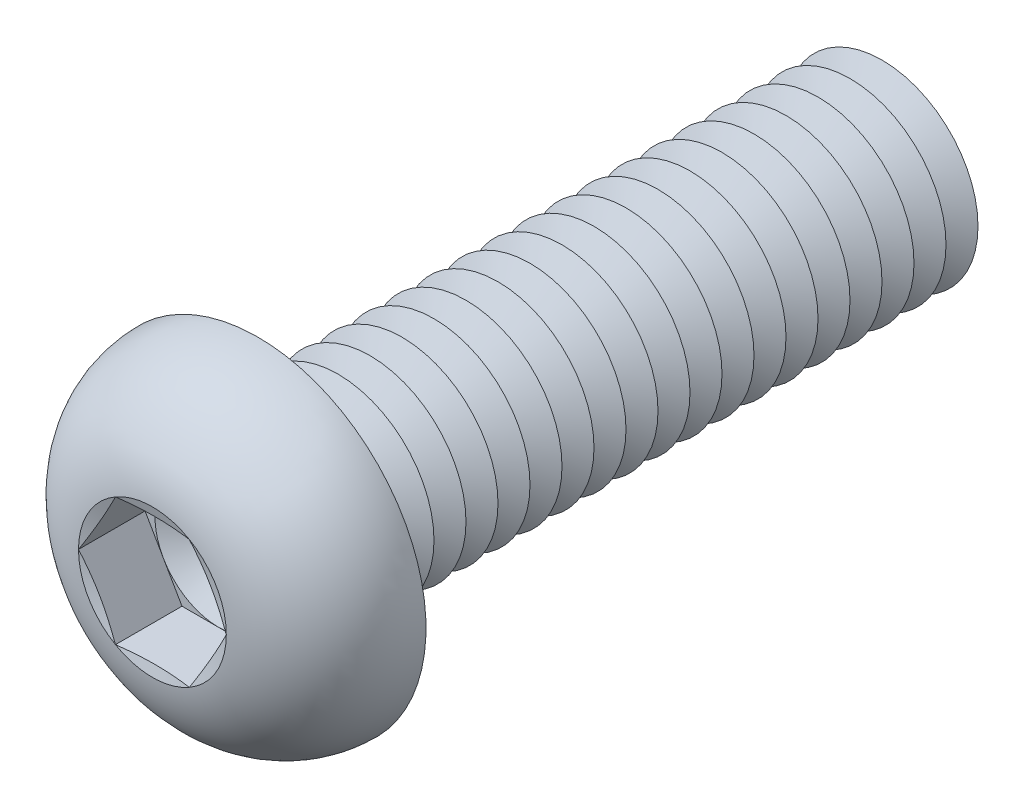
ISO-10303-21;
HEADER;
FILE_DESCRIPTION(('STEP AP214'),'2;1');
FILE_NAME('part.step','',(''),(''),'','','');
FILE_SCHEMA(('AUTOMOTIVE_DESIGN { 1 0 10303 214 1 1 1 1 }'));
ENDSEC;
DATA;
#1=APPLICATION_CONTEXT('core data for automotive mechanical design processes');
#2=APPLICATION_PROTOCOL_DEFINITION('international standard','automotive_design',2000,#1);
#3=PRODUCT_CONTEXT('',#1,'mechanical');
#4=PRODUCT('Part','Part','',(#3));
#5=PRODUCT_RELATED_PRODUCT_CATEGORY('part','',(#4));
#6=PRODUCT_DEFINITION_FORMATION('','',#4);
#7=PRODUCT_DEFINITION_CONTEXT('part definition',#1,'design');
#8=PRODUCT_DEFINITION('design','',#6,#7);
#9=PRODUCT_DEFINITION_SHAPE('','',#8);
#10=(LENGTH_UNIT() NAMED_UNIT(*) SI_UNIT(.MILLI.,.METRE.));
#11=(NAMED_UNIT(*) PLANE_ANGLE_UNIT() SI_UNIT($,.RADIAN.));
#12=(NAMED_UNIT(*) SI_UNIT($,.STERADIAN.) SOLID_ANGLE_UNIT());
#13=UNCERTAINTY_MEASURE_WITH_UNIT(LENGTH_MEASURE(1.E-05),#10,'distance_accuracy_value','');
#14=(GEOMETRIC_REPRESENTATION_CONTEXT(3) GLOBAL_UNCERTAINTY_ASSIGNED_CONTEXT((#13)) GLOBAL_UNIT_ASSIGNED_CONTEXT((#10,
#11,#12)) REPRESENTATION_CONTEXT('',''));
#15=CARTESIAN_POINT('',(0.,0.,0.));
#16=DIRECTION('',(0.,0.,1.));
#17=DIRECTION('',(1.,0.,0.));
#18=AXIS2_PLACEMENT_3D('',#15,#16,#17);
#19=CARTESIAN_POINT('',(0.,0.,1.22));
#20=DIRECTION('',(0.,0.,1.));
#21=DIRECTION('',(1.,0.,0.));
#22=AXIS2_PLACEMENT_3D('',#19,#20,#21);
#23=PLANE('',#22);
#24=CARTESIAN_POINT('',(0.,0.,1.22));
#25=DIRECTION('',(0.,0.,1.));
#26=DIRECTION('',(1.,0.,0.));
#27=AXIS2_PLACEMENT_3D('',#24,#25,#26);
#28=CIRCLE('',#27,1.99999906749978);
#29=CARTESIAN_POINT('',(1.73205,0.999999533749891,1.22));
#30=VERTEX_POINT('',#29);
#31=CARTESIAN_POINT('',(0.,1.99999906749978,1.22));
#32=VERTEX_POINT('',#31);
#33=EDGE_CURVE('E118',#30,#32,#28,.T.);
#34=ORIENTED_EDGE('',*,*,#33,.F.);
#35=DIRECTION('',(-0.5,0.866025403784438,0.));
#36=VECTOR('',#35,1.);
#37=CARTESIAN_POINT('',(2.3094,0.,1.22));
#38=LINE('',#37,#36);
#39=CARTESIAN_POINT('',(1.1547,1.99999906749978,1.22));
#40=VERTEX_POINT('',#39);
#41=EDGE_CURVE('E125',#30,#40,#38,.T.);
#42=ORIENTED_EDGE('',*,*,#41,.T.);
#43=DIRECTION('',(-1.,0.,0.));
#44=VECTOR('',#43,1.);
#45=CARTESIAN_POINT('',(1.1547,1.99999906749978,1.22));
#46=LINE('',#45,#44);
#47=EDGE_CURVE('E136',#40,#32,#46,.T.);
#48=ORIENTED_EDGE('',*,*,#47,.T.);
#49=EDGE_LOOP('',(#34,#42,#48));
#50=FACE_BOUND('',#49,.T.);
#51=ADVANCED_FACE('F39',(#50),#23,.T.);
#52=CARTESIAN_POINT('',(0.,0.,1.22));
#53=DIRECTION('',(0.,0.,1.));
#54=DIRECTION('',(1.,0.,0.));
#55=AXIS2_PLACEMENT_3D('',#52,#53,#54);
#56=CIRCLE('',#55,1.99999906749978);
#57=CARTESIAN_POINT('',(-1.73205,0.999999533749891,1.22));
#58=VERTEX_POINT('',#57);
#59=EDGE_CURVE('E11',#32,#58,#56,.T.);
#60=ORIENTED_EDGE('',*,*,#59,.F.);
#61=CARTESIAN_POINT('',(-1.1547,1.99999906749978,1.22));
#62=VERTEX_POINT('',#61);
#63=EDGE_CURVE('E131',#32,#62,#46,.T.);
#64=ORIENTED_EDGE('',*,*,#63,.T.);
#65=DIRECTION('',(-0.5,-0.866025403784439,0.));
#66=VECTOR('',#65,1.);
#67=CARTESIAN_POINT('',(-1.1547,1.99999906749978,1.22));
#68=LINE('',#67,#66);
#69=EDGE_CURVE('E134',#62,#58,#68,.T.);
#70=ORIENTED_EDGE('',*,*,#69,.T.);
#71=EDGE_LOOP('',(#60,#64,#70));
#72=FACE_BOUND('',#71,.T.);
#73=ADVANCED_FACE('F130',(#72),#23,.T.);
#74=CARTESIAN_POINT('',(-1.73205,-0.999999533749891,1.22));
#75=VERTEX_POINT('',#74);
#76=EDGE_CURVE('E49',#58,#75,#56,.T.);
#77=ORIENTED_EDGE('',*,*,#76,.F.);
#78=CARTESIAN_POINT('',(-2.3094,0.,1.22));
#79=VERTEX_POINT('',#78);
#80=EDGE_CURVE('E143',#58,#79,#68,.T.);
#81=ORIENTED_EDGE('',*,*,#80,.T.);
#82=DIRECTION('',(0.5,-0.866025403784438,0.));
#83=VECTOR('',#82,1.);
#84=CARTESIAN_POINT('',(-2.3094,0.,1.22));
#85=LINE('',#84,#83);
#86=EDGE_CURVE('E151',#79,#75,#85,.T.);
#87=ORIENTED_EDGE('',*,*,#86,.T.);
#88=EDGE_LOOP('',(#77,#81,#87));
#89=FACE_BOUND('',#88,.T.);
#90=ADVANCED_FACE('F430',(#89),#23,.T.);
#91=CARTESIAN_POINT('',(0.,-1.99999906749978,1.22));
#92=VERTEX_POINT('',#91);
#93=EDGE_CURVE('E411',#75,#92,#56,.T.);
#94=ORIENTED_EDGE('',*,*,#93,.F.);
#95=CARTESIAN_POINT('',(-1.1547,-1.99999906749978,1.22));
#96=VERTEX_POINT('',#95);
#97=EDGE_CURVE('E150',#75,#96,#85,.T.);
#98=ORIENTED_EDGE('',*,*,#97,.T.);
#99=DIRECTION('',(1.,0.,0.));
#100=VECTOR('',#99,1.);
#101=CARTESIAN_POINT('',(-1.1547,-1.99999906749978,1.22));
#102=LINE('',#101,#100);
#103=EDGE_CURVE('E156',#96,#92,#102,.T.);
#104=ORIENTED_EDGE('',*,*,#103,.T.);
#105=EDGE_LOOP('',(#94,#98,#104));
#106=FACE_BOUND('',#105,.T.);
#107=ADVANCED_FACE('F423',(#106),#23,.T.);
#108=CARTESIAN_POINT('',(1.73205,-0.999999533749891,1.22));
#109=VERTEX_POINT('',#108);
#110=EDGE_CURVE('E56',#92,#109,#56,.T.);
#111=ORIENTED_EDGE('',*,*,#110,.F.);
#112=CARTESIAN_POINT('',(1.1547,-1.99999906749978,1.22));
#113=VERTEX_POINT('',#112);
#114=EDGE_CURVE('E155',#92,#113,#102,.T.);
#115=ORIENTED_EDGE('',*,*,#114,.T.);
#116=DIRECTION('',(0.5,0.866025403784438,0.));
#117=VECTOR('',#116,1.);
#118=CARTESIAN_POINT('',(1.1547,-1.99999906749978,1.22));
#119=LINE('',#118,#117);
#120=EDGE_CURVE('E161',#113,#109,#119,.T.);
#121=ORIENTED_EDGE('',*,*,#120,.T.);
#122=EDGE_LOOP('',(#111,#115,#121));
#123=FACE_BOUND('',#122,.T.);
#124=ADVANCED_FACE('F494',(#123),#23,.T.);
#125=CARTESIAN_POINT('',(0.,0.,3.3));
#126=DIRECTION('',(0.,0.,1.));
#127=DIRECTION('',(1.,0.,0.));
#128=AXIS2_PLACEMENT_3D('',#125,#126,#127);
#129=CONICAL_SURFACE('',#128,2.3094,1.30899693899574);
#130=CARTESIAN_POINT('',(2.30951547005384,-0.000199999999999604,3.30003094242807));
#131=CARTESIAN_POINT('',(2.26155412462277,0.0828714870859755,3.2871729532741));
#132=CARTESIAN_POINT('',(2.21350580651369,0.16609361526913,3.27549992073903));
#133=CARTESIAN_POINT('',(2.11723944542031,0.332831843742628,3.2549913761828));
#134=CARTESIAN_POINT('',(2.06902134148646,0.416348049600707,3.24615701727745));
#135=CARTESIAN_POINT('',(1.97270782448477,0.583167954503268,3.23184167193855));
#136=CARTESIAN_POINT('',(1.92461306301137,0.666470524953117,3.22634360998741));
#137=CARTESIAN_POINT('',(1.82836219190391,0.83318192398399,3.21897125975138));
#138=CARTESIAN_POINT('',(1.78020609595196,0.91659072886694,3.21709626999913));
#139=CARTESIAN_POINT('',(1.68389390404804,1.08340833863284,3.21709626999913));
#140=CARTESIAN_POINT('',(1.63573780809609,1.16681714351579,3.21897125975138));
#141=CARTESIAN_POINT('',(1.53948693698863,1.33352854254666,3.22634360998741));
#142=CARTESIAN_POINT('',(1.49139217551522,1.41683111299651,3.23184167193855));
#143=CARTESIAN_POINT('',(1.39507865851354,1.58365101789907,3.24615701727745));
#144=CARTESIAN_POINT('',(1.34686055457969,1.66716722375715,3.2549913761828));
#145=CARTESIAN_POINT('',(1.25059419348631,1.83390545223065,3.27549992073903));
#146=CARTESIAN_POINT('',(1.20254587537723,1.91712758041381,3.2871729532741));
#147=CARTESIAN_POINT('',(1.15458452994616,2.00019906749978,3.30003094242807));
#148=B_SPLINE_CURVE_WITH_KNOTS('',3,(#130,#131,#132,#133,#134,#135,#136,#137,#138,#139,#140,
#141,#142,#143,#144,#145,#146,#147),.UNSPECIFIED.,.F.,.F.,(4,2,2,2,2,2,2,2,4),(0.,
0.290357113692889,0.580832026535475,0.869807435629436,1.15872689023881,1.44764634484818,
1.73662175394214,2.02709666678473,2.31745378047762),.UNSPECIFIED.);
#149=CARTESIAN_POINT('',(2.3094,0.,3.3));
#150=VERTEX_POINT('',#149);
#151=CARTESIAN_POINT('',(1.15469999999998,1.99999906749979,3.3));
#152=VERTEX_POINT('',#151);
#153=EDGE_CURVE('E220',#150,#152,#148,.T.);
#154=ORIENTED_EDGE('',*,*,#153,.F.);
#155=CARTESIAN_POINT('',(0.,0.,3.3));
#156=DIRECTION('',(0.,0.,-1.));
#157=DIRECTION('',(-1.,0.,0.));
#158=AXIS2_PLACEMENT_3D('',#155,#156,#157);
#159=CIRCLE('',#158,2.3094);
#160=EDGE_CURVE('E458',#152,#150,#159,.T.);
#161=ORIENTED_EDGE('',*,*,#160,.F.);
#162=EDGE_LOOP('',(#154,#161));
#163=FACE_BOUND('',#162,.T.);
#164=ADVANCED_FACE('F498',(#163),#129,.F.);
#165=CARTESIAN_POINT('',(1.15458452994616,-2.00019906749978,3.30003094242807));
#166=CARTESIAN_POINT('',(1.20254587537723,-1.91712758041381,3.2871729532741));
#167=CARTESIAN_POINT('',(1.25059419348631,-1.83390545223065,3.27549992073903));
#168=CARTESIAN_POINT('',(1.34686055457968,-1.66716722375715,3.2549913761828));
#169=CARTESIAN_POINT('',(1.39507865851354,-1.58365101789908,3.24615701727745));
#170=CARTESIAN_POINT('',(1.49139217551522,-1.41683111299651,3.23184167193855));
#171=CARTESIAN_POINT('',(1.53948693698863,-1.33352854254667,3.22634360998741));
#172=CARTESIAN_POINT('',(1.63573780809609,-1.16681714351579,3.21897125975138));
#173=CARTESIAN_POINT('',(1.68389390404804,-1.08340833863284,3.21709626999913));
#174=CARTESIAN_POINT('',(1.78020609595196,-0.916590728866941,3.21709626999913));
#175=CARTESIAN_POINT('',(1.82836219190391,-0.83318192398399,3.21897125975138));
#176=CARTESIAN_POINT('',(1.92461306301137,-0.666470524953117,3.22634360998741));
#177=CARTESIAN_POINT('',(1.97270782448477,-0.583167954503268,3.23184167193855));
#178=CARTESIAN_POINT('',(2.06902134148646,-0.416348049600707,3.24615701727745));
#179=CARTESIAN_POINT('',(2.11723944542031,-0.332831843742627,3.2549913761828));
#180=CARTESIAN_POINT('',(2.21350580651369,-0.166093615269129,3.27549992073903));
#181=CARTESIAN_POINT('',(2.26155412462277,-0.0828714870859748,3.2871729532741));
#182=CARTESIAN_POINT('',(2.30951547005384,0.000200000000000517,3.30003094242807));
#183=B_SPLINE_CURVE_WITH_KNOTS('',3,(#165,#166,#167,#168,#169,#170,#171,#172,#173,#174,#175,
#176,#177,#178,#179,#180,#181,#182),.UNSPECIFIED.,.F.,.F.,(4,2,2,2,2,2,2,2,4),(0.,
0.290357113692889,0.580832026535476,0.869807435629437,1.15872689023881,1.44764634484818,
1.73662175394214,2.02709666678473,2.31745378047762),.UNSPECIFIED.);
#184=CARTESIAN_POINT('',(1.1547,-1.99999906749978,3.3));
#185=VERTEX_POINT('',#184);
#186=EDGE_CURVE('E229',#185,#150,#183,.T.);
#187=ORIENTED_EDGE('',*,*,#186,.F.);
#188=EDGE_CURVE('E460',#150,#185,#159,.T.);
#189=ORIENTED_EDGE('',*,*,#188,.F.);
#190=EDGE_LOOP('',(#187,#189));
#191=FACE_BOUND('',#190,.T.);
#192=ADVANCED_FACE('F504',(#191),#129,.F.);
#193=CARTESIAN_POINT('',(-3.4849337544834,-1.99999906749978,3.75783251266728));
#194=CARTESIAN_POINT('',(-3.40057136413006,-1.99999906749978,3.7382285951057));
#195=CARTESIAN_POINT('',(-3.31617090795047,-1.99999906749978,3.71878852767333));
#196=CARTESIAN_POINT('',(-3.14727791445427,-1.99999906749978,3.68030638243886));
#197=CARTESIAN_POINT('',(-3.06278537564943,-1.99999906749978,3.6612643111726));
#198=CARTESIAN_POINT('',(-2.80911712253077,-1.99999906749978,3.604834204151));
#199=CARTESIAN_POINT('',(-2.63978343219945,-1.99999906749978,3.5681499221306));
#200=CARTESIAN_POINT('',(-2.29895421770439,-1.99999906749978,3.49717072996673));
#201=CARTESIAN_POINT('',(-2.12745330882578,-1.99999906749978,3.4629014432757));
#202=CARTESIAN_POINT('',(-1.78364663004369,-1.99999906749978,3.39849485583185));
#203=CARTESIAN_POINT('',(-1.61134079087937,-1.99999906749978,3.36835791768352));
#204=CARTESIAN_POINT('',(-1.27040784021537,-1.99999906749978,3.31501553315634));
#205=CARTESIAN_POINT('',(-1.10180724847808,-1.99999906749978,3.29164468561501));
#206=CARTESIAN_POINT('',(-0.763641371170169,-1.99999906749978,3.2533727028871));
#207=CARTESIAN_POINT('',(-0.594076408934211,-1.99999906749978,3.23846888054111));
#208=CARTESIAN_POINT('',(-0.339649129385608,-1.99999906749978,3.22431372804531));
#209=CARTESIAN_POINT('',(-0.255009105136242,-1.99999906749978,3.22096057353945));
#210=CARTESIAN_POINT('',(-0.0856618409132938,-1.99999906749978,3.21711210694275));
#211=CARTESIAN_POINT('',(-0.000954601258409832,-1.99999906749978,3.21661678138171));
#212=CARTESIAN_POINT('',(0.168430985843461,-1.99999906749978,3.21851478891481));
#213=CARTESIAN_POINT('',(0.253109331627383,-1.99999906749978,3.22090826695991));
#214=CARTESIAN_POINT('',(0.4223440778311,-1.99999906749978,3.22845792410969));
#215=CARTESIAN_POINT('',(0.506900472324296,-1.99999906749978,3.23361423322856));
#216=CARTESIAN_POINT('',(0.712240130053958,-1.99999906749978,3.24921577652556));
#217=CARTESIAN_POINT('',(0.832922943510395,-1.99999906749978,3.26098285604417));
#218=CARTESIAN_POINT('',(1.07378161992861,-1.99999906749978,3.28874908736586));
#219=CARTESIAN_POINT('',(1.1939575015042,-1.99999906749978,3.30474808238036));
#220=CARTESIAN_POINT('',(1.43419655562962,-1.99999906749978,3.34009172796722));
#221=CARTESIAN_POINT('',(1.55425817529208,-1.99999906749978,3.35944677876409));
#222=CARTESIAN_POINT('',(1.79394991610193,-1.99999906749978,3.40067076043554));
#223=CARTESIAN_POINT('',(1.91358001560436,-1.99999906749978,3.42253981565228));
#224=CARTESIAN_POINT('',(2.15493405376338,-1.99999906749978,3.46864194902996));
#225=CARTESIAN_POINT('',(2.27665041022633,-1.99999906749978,3.49291441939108));
#226=CARTESIAN_POINT('',(2.51977680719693,-1.99999906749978,3.54294628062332));
#227=CARTESIAN_POINT('',(2.64118684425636,-1.99999906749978,3.56870568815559));
#228=CARTESIAN_POINT('',(2.88310060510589,-1.99999906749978,3.6212089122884));
#229=CARTESIAN_POINT('',(3.00360566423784,-1.99999906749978,3.64794660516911));
#230=CARTESIAN_POINT('',(3.24441021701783,-1.99999906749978,3.70229477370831));
#231=CARTESIAN_POINT('',(3.36470972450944,-1.99999906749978,3.7299051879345));
#232=CARTESIAN_POINT('',(3.4849337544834,-1.99999906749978,3.75783251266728));
#233=B_SPLINE_CURVE_WITH_KNOTS('',3,(#193,#194,#195,#196,#197,#198,#199,#200,#201,#202,#203,
#204,#205,#206,#207,#208,#209,#210,#211,#212,#213,#214,#215,#216,#217,#218,#219,#220,#221,#222,
#223,#224,#225,#226,#227,#228,#229,#230,#231,#232),.UNSPECIFIED.,.F.,.F.,(4,2,2,2,2,2,2,2,2,2,2,
2,2,2,2,2,2,2,2,4),(0.,0.259830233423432,0.519664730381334,1.03943435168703,1.56407662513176,
2.08876490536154,2.59926476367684,3.10960251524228,3.36367930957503,3.61775490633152,
3.87184325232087,4.1259435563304,4.48960924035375,4.85326145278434,5.21806142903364,
5.58287945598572,5.95520617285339,6.32753706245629,6.69784064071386,7.06811821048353),.UNSPECIFIED.);
#234=CARTESIAN_POINT('',(-1.1547,-1.99999906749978,3.3));
#235=VERTEX_POINT('',#234);
#236=EDGE_CURVE('E441',#235,#185,#233,.T.);
#237=ORIENTED_EDGE('',*,*,#236,.F.);
#238=EDGE_CURVE('E449',#185,#235,#159,.T.);
#239=ORIENTED_EDGE('',*,*,#238,.F.);
#240=EDGE_LOOP('',(#237,#239));
#241=FACE_BOUND('',#240,.T.);
#242=ADVANCED_FACE('F519',(#241),#129,.F.);
#243=CARTESIAN_POINT('',(-2.30951547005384,0.000200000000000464,3.30003094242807));
#244=CARTESIAN_POINT('',(-2.26155412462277,-0.0828714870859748,3.2871729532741));
#245=CARTESIAN_POINT('',(-2.21350580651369,-0.166093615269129,3.27549992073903));
#246=CARTESIAN_POINT('',(-2.11723944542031,-0.332831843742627,3.2549913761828));
#247=CARTESIAN_POINT('',(-2.06902134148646,-0.416348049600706,3.24615701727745));
#248=CARTESIAN_POINT('',(-1.97270782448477,-0.583167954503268,3.23184167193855));
#249=CARTESIAN_POINT('',(-1.92461306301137,-0.666470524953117,3.22634360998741));
#250=CARTESIAN_POINT('',(-1.82836219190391,-0.83318192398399,3.21897125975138));
#251=CARTESIAN_POINT('',(-1.78020609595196,-0.91659072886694,3.21709626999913));
#252=CARTESIAN_POINT('',(-1.68389390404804,-1.08340833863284,3.21709626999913));
#253=CARTESIAN_POINT('',(-1.63573780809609,-1.16681714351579,3.21897125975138));
#254=CARTESIAN_POINT('',(-1.53948693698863,-1.33352854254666,3.22634360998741));
#255=CARTESIAN_POINT('',(-1.49139217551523,-1.41683111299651,3.23184167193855));
#256=CARTESIAN_POINT('',(-1.39507865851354,-1.58365101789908,3.24615701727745));
#257=CARTESIAN_POINT('',(-1.34686055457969,-1.66716722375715,3.2549913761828));
#258=CARTESIAN_POINT('',(-1.25059419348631,-1.83390545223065,3.27549992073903));
#259=CARTESIAN_POINT('',(-1.20254587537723,-1.91712758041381,3.2871729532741));
#260=CARTESIAN_POINT('',(-1.15458452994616,-2.00019906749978,3.30003094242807));
#261=B_SPLINE_CURVE_WITH_KNOTS('',3,(#243,#244,#245,#246,#247,#248,#249,#250,#251,#252,#253,
#254,#255,#256,#257,#258,#259,#260),.UNSPECIFIED.,.F.,.F.,(4,2,2,2,2,2,2,2,4),(0.,
0.290357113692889,0.580832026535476,0.869807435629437,1.15872689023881,1.44764634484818,
1.73662175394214,2.02709666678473,2.31745378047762),.UNSPECIFIED.);
#262=CARTESIAN_POINT('',(-2.3094,0.,3.3));
#263=VERTEX_POINT('',#262);
#264=EDGE_CURVE('E435',#263,#235,#261,.T.);
#265=ORIENTED_EDGE('',*,*,#264,.F.);
#266=EDGE_CURVE('E395',#235,#263,#159,.T.);
#267=ORIENTED_EDGE('',*,*,#266,.F.);
#268=EDGE_LOOP('',(#265,#267));
#269=FACE_BOUND('',#268,.T.);
#270=ADVANCED_FACE('F439',(#269),#129,.F.);
#271=CARTESIAN_POINT('',(-1.15458452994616,2.00019906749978,3.30003094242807));
#272=CARTESIAN_POINT('',(-1.20254587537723,1.91712758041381,3.2871729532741));
#273=CARTESIAN_POINT('',(-1.25059419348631,1.83390545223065,3.27549992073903));
#274=CARTESIAN_POINT('',(-1.34686055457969,1.66716722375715,3.2549913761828));
#275=CARTESIAN_POINT('',(-1.39507865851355,1.58365101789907,3.24615701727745));
#276=CARTESIAN_POINT('',(-1.49139217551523,1.41683111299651,3.23184167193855));
#277=CARTESIAN_POINT('',(-1.53948693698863,1.33352854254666,3.22634360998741));
#278=CARTESIAN_POINT('',(-1.63573780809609,1.16681714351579,3.21897125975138));
#279=CARTESIAN_POINT('',(-1.68389390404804,1.08340833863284,3.21709626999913));
#280=CARTESIAN_POINT('',(-1.78020609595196,0.91659072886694,3.21709626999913));
#281=CARTESIAN_POINT('',(-1.82836219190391,0.83318192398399,3.21897125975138));
#282=CARTESIAN_POINT('',(-1.92461306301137,0.666470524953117,3.22634360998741));
#283=CARTESIAN_POINT('',(-1.97270782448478,0.583167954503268,3.23184167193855));
#284=CARTESIAN_POINT('',(-2.06902134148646,0.416348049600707,3.24615701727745));
#285=CARTESIAN_POINT('',(-2.11723944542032,0.332831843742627,3.2549913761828));
#286=CARTESIAN_POINT('',(-2.21350580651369,0.166093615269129,3.27549992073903));
#287=CARTESIAN_POINT('',(-2.26155412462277,0.0828714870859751,3.2871729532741));
#288=CARTESIAN_POINT('',(-2.30951547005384,-0.000199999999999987,3.30003094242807));
#289=B_SPLINE_CURVE_WITH_KNOTS('',3,(#271,#272,#273,#274,#275,#276,#277,#278,#279,#280,#281,
#282,#283,#284,#285,#286,#287,#288),.UNSPECIFIED.,.F.,.F.,(4,2,2,2,2,2,2,2,4),(0.,
0.290357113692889,0.580832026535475,0.869807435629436,1.15872689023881,1.44764634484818,
1.73662175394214,2.02709666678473,2.31745378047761),.UNSPECIFIED.);
#290=CARTESIAN_POINT('',(-1.1547,1.99999906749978,3.3));
#291=VERTEX_POINT('',#290);
#292=EDGE_CURVE('E194',#291,#263,#289,.T.);
#293=ORIENTED_EDGE('',*,*,#292,.F.);
#294=EDGE_CURVE('E396',#263,#291,#159,.T.);
#295=ORIENTED_EDGE('',*,*,#294,.F.);
#296=EDGE_LOOP('',(#293,#295));
#297=FACE_BOUND('',#296,.T.);
#298=ADVANCED_FACE('F452',(#297),#129,.F.);
#299=CARTESIAN_POINT('',(0.,0.,-16.5));
#300=DIRECTION('',(0.,0.,1.));
#301=DIRECTION('',(1.,0.,0.));
#302=AXIS2_PLACEMENT_3D('',#299,#300,#301);
#303=CONICAL_SURFACE('',#302,3.,1.0471975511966);
#304=CARTESIAN_POINT('',(0.,0.,-17.));
#305=DIRECTION('',(0.,0.,1.));
#306=DIRECTION('',(1.,0.,0.));
#307=AXIS2_PLACEMENT_3D('',#304,#305,#306);
#308=CIRCLE('',#307,2.13397459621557);
#309=CARTESIAN_POINT('',(2.13397459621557,0.,-17.));
#310=VERTEX_POINT('',#309);
#311=EDGE_CURVE('E367',#310,#310,#308,.T.);
#312=ORIENTED_EDGE('',*,*,#311,.T.);
#313=EDGE_LOOP('',(#312));
#314=FACE_BOUND('',#313,.T.);
#315=CARTESIAN_POINT('',(0.,0.,-16.5));
#316=DIRECTION('',(0.,0.,1.));
#317=DIRECTION('',(1.,0.,0.));
#318=AXIS2_PLACEMENT_3D('',#315,#316,#317);
#319=CIRCLE('',#318,3.);
#320=CARTESIAN_POINT('',(3.,0.,-16.5));
#321=VERTEX_POINT('',#320);
#322=EDGE_CURVE('E363',#321,#321,#319,.T.);
#323=ORIENTED_EDGE('',*,*,#322,.F.);
#324=EDGE_LOOP('',(#323));
#325=FACE_BOUND('',#324,.T.);
#326=ADVANCED_FACE('F585',(#314,#325),#303,.T.);
#327=CARTESIAN_POINT('',(0.,0.,-17.));
#328=DIRECTION('',(0.,0.,-1.));
#329=DIRECTION('',(-1.,0.,0.));
#330=AXIS2_PLACEMENT_3D('',#327,#328,#329);
#331=CONICAL_SURFACE('',#330,2.13397459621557,1.0471975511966);
#332=CARTESIAN_POINT('',(0.,0.,-17.5));
#333=DIRECTION('',(0.,0.,1.));
#334=DIRECTION('',(1.,0.,0.));
#335=AXIS2_PLACEMENT_3D('',#332,#333,#334);
#336=CIRCLE('',#335,3.);
#337=CARTESIAN_POINT('',(3.,0.,-17.5));
#338=VERTEX_POINT('',#337);
#339=EDGE_CURVE('E371',#338,#338,#336,.T.);
#340=ORIENTED_EDGE('',*,*,#339,.T.);
#341=EDGE_LOOP('',(#340));
#342=FACE_BOUND('',#341,.T.);
#343=ORIENTED_EDGE('',*,*,#311,.F.);
#344=EDGE_LOOP('',(#343));
#345=FACE_BOUND('',#344,.T.);
#346=ADVANCED_FACE('F936',(#342,#345),#331,.T.);
#347=CARTESIAN_POINT('',(0.,3.00000000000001,-20.));
#348=DIRECTION('',(0.,0.,-1.));
#349=DIRECTION('',(-1.,0.,0.));
#350=AXIS2_PLACEMENT_3D('',#347,#348,#349);
#351=PLANE('',#350);
#352=CARTESIAN_POINT('',(0.,0.,-20.));
#353=DIRECTION('',(0.,0.,1.));
#354=DIRECTION('',(1.,0.,0.));
#355=AXIS2_PLACEMENT_3D('',#352,#353,#354);
#356=CIRCLE('',#355,2.13397459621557);
#357=CARTESIAN_POINT('',(2.13397459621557,0.,-20.));
#358=VERTEX_POINT('',#357);
#359=EDGE_CURVE('E391',#358,#358,#356,.T.);
#360=ORIENTED_EDGE('',*,*,#359,.F.);
#361=EDGE_LOOP('',(#360));
#362=FACE_BOUND('',#361,.T.);
#363=ADVANCED_FACE('F930',(#362),#351,.T.);
#364=CARTESIAN_POINT('',(0.,0.,-19.5));
#365=DIRECTION('',(0.,0.,1.));
#366=DIRECTION('',(1.,0.,0.));
#367=AXIS2_PLACEMENT_3D('',#364,#365,#366);
#368=CONICAL_SURFACE('',#367,3.,1.0471975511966);
#369=ORIENTED_EDGE('',*,*,#359,.T.);
#370=EDGE_LOOP('',(#369));
#371=FACE_BOUND('',#370,.T.);
#372=CARTESIAN_POINT('',(0.,0.,-19.5));
#373=DIRECTION('',(0.,0.,1.));
#374=DIRECTION('',(1.,0.,0.));
#375=AXIS2_PLACEMENT_3D('',#372,#373,#374);
#376=CIRCLE('',#375,3.);
#377=CARTESIAN_POINT('',(3.,0.,-19.5));
#378=VERTEX_POINT('',#377);
#379=EDGE_CURVE('E387',#378,#378,#376,.T.);
#380=ORIENTED_EDGE('',*,*,#379,.F.);
#381=EDGE_LOOP('',(#380));
#382=FACE_BOUND('',#381,.T.);
#383=ADVANCED_FACE('F923',(#371,#382),#368,.T.);
#384=CARTESIAN_POINT('',(0.,0.,-19.));
#385=DIRECTION('',(0.,0.,-1.));
#386=DIRECTION('',(-1.,0.,0.));
#387=AXIS2_PLACEMENT_3D('',#384,#385,#386);
#388=CONICAL_SURFACE('',#387,2.13397459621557,1.0471975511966);
#389=ORIENTED_EDGE('',*,*,#379,.T.);
#390=EDGE_LOOP('',(#389));
#391=FACE_BOUND('',#390,.T.);
#392=CARTESIAN_POINT('',(0.,0.,-19.));
#393=DIRECTION('',(0.,0.,1.));
#394=DIRECTION('',(1.,0.,0.));
#395=AXIS2_PLACEMENT_3D('',#392,#393,#394);
#396=CIRCLE('',#395,2.13397459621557);
#397=CARTESIAN_POINT('',(2.13397459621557,0.,-19.));
#398=VERTEX_POINT('',#397);
#399=EDGE_CURVE('E383',#398,#398,#396,.T.);
#400=ORIENTED_EDGE('',*,*,#399,.F.);
#401=EDGE_LOOP('',(#400));
#402=FACE_BOUND('',#401,.T.);
#403=ADVANCED_FACE('F916',(#391,#402),#388,.T.);
#404=CARTESIAN_POINT('',(0.,0.,-18.5));
#405=DIRECTION('',(0.,0.,1.));
#406=DIRECTION('',(1.,0.,0.));
#407=AXIS2_PLACEMENT_3D('',#404,#405,#406);
#408=CONICAL_SURFACE('',#407,3.,1.0471975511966);
#409=ORIENTED_EDGE('',*,*,#399,.T.);
#410=EDGE_LOOP('',(#409));
#411=FACE_BOUND('',#410,.T.);
#412=CARTESIAN_POINT('',(0.,0.,-18.5));
#413=DIRECTION('',(0.,0.,1.));
#414=DIRECTION('',(1.,0.,0.));
#415=AXIS2_PLACEMENT_3D('',#412,#413,#414);
#416=CIRCLE('',#415,3.);
#417=CARTESIAN_POINT('',(3.,0.,-18.5));
#418=VERTEX_POINT('',#417);
#419=EDGE_CURVE('E379',#418,#418,#416,.T.);
#420=ORIENTED_EDGE('',*,*,#419,.F.);
#421=EDGE_LOOP('',(#420));
#422=FACE_BOUND('',#421,.T.);
#423=ADVANCED_FACE('F909',(#411,#422),#408,.T.);
#424=CARTESIAN_POINT('',(0.,0.,-18.));
#425=DIRECTION('',(0.,0.,-1.));
#426=DIRECTION('',(-1.,0.,0.));
#427=AXIS2_PLACEMENT_3D('',#424,#425,#426);
#428=CONICAL_SURFACE('',#427,2.13397459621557,1.0471975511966);
#429=ORIENTED_EDGE('',*,*,#419,.T.);
#430=EDGE_LOOP('',(#429));
#431=FACE_BOUND('',#430,.T.);
#432=CARTESIAN_POINT('',(0.,0.,-18.));
#433=DIRECTION('',(0.,0.,1.));
#434=DIRECTION('',(1.,0.,0.));
#435=AXIS2_PLACEMENT_3D('',#432,#433,#434);
#436=CIRCLE('',#435,2.13397459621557);
#437=CARTESIAN_POINT('',(2.13397459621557,0.,-18.));
#438=VERTEX_POINT('',#437);
#439=EDGE_CURVE('E375',#438,#438,#436,.T.);
#440=ORIENTED_EDGE('',*,*,#439,.F.);
#441=EDGE_LOOP('',(#440));
#442=FACE_BOUND('',#441,.T.);
#443=ADVANCED_FACE('F902',(#431,#442),#428,.T.);
#444=CARTESIAN_POINT('',(0.,0.,-17.5));
#445=DIRECTION('',(0.,0.,1.));
#446=DIRECTION('',(1.,0.,0.));
#447=AXIS2_PLACEMENT_3D('',#444,#445,#446);
#448=CONICAL_SURFACE('',#447,3.,1.0471975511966);
#449=ORIENTED_EDGE('',*,*,#439,.T.);
#450=EDGE_LOOP('',(#449));
#451=FACE_BOUND('',#450,.T.);
#452=ORIENTED_EDGE('',*,*,#339,.F.);
#453=EDGE_LOOP('',(#452));
#454=FACE_BOUND('',#453,.T.);
#455=ADVANCED_FACE('F895',(#451,#454),#448,.T.);
#456=CARTESIAN_POINT('',(0.,0.,-15.5));
#457=DIRECTION('',(0.,0.,1.));
#458=DIRECTION('',(1.,0.,0.));
#459=AXIS2_PLACEMENT_3D('',#456,#457,#458);
#460=CONICAL_SURFACE('',#459,3.,1.0471975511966);
#461=CARTESIAN_POINT('',(0.,0.,-16.));
#462=DIRECTION('',(0.,0.,1.));
#463=DIRECTION('',(1.,0.,0.));
#464=AXIS2_PLACEMENT_3D('',#461,#462,#463);
#465=CIRCLE('',#464,2.13397459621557);
#466=CARTESIAN_POINT('',(2.13397459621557,0.,-16.));
#467=VERTEX_POINT('',#466);
#468=EDGE_CURVE('E359',#467,#467,#465,.T.);
#469=ORIENTED_EDGE('',*,*,#468,.T.);
#470=EDGE_LOOP('',(#469));
#471=FACE_BOUND('',#470,.T.);
#472=CARTESIAN_POINT('',(0.,0.,-15.5));
#473=DIRECTION('',(0.,0.,1.));
#474=DIRECTION('',(1.,0.,0.));
#475=AXIS2_PLACEMENT_3D('',#472,#473,#474);
#476=CIRCLE('',#475,3.);
#477=CARTESIAN_POINT('',(3.,0.,-15.5));
#478=VERTEX_POINT('',#477);
#479=EDGE_CURVE('E355',#478,#478,#476,.T.);
#480=ORIENTED_EDGE('',*,*,#479,.F.);
#481=EDGE_LOOP('',(#480));
#482=FACE_BOUND('',#481,.T.);
#483=ADVANCED_FACE('F888',(#471,#482),#460,.T.);
#484=CARTESIAN_POINT('',(0.,0.,-16.));
#485=DIRECTION('',(0.,0.,-1.));
#486=DIRECTION('',(-1.,0.,0.));
#487=AXIS2_PLACEMENT_3D('',#484,#485,#486);
#488=CONICAL_SURFACE('',#487,2.13397459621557,1.0471975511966);
#489=ORIENTED_EDGE('',*,*,#322,.T.);
#490=EDGE_LOOP('',(#489));
#491=FACE_BOUND('',#490,.T.);
#492=ORIENTED_EDGE('',*,*,#468,.F.);
#493=EDGE_LOOP('',(#492));
#494=FACE_BOUND('',#493,.T.);
#495=ADVANCED_FACE('F881',(#491,#494),#488,.T.);
#496=CARTESIAN_POINT('',(0.,0.,-14.5));
#497=DIRECTION('',(0.,0.,1.));
#498=DIRECTION('',(1.,0.,0.));
#499=AXIS2_PLACEMENT_3D('',#496,#497,#498);
#500=CONICAL_SURFACE('',#499,3.,1.0471975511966);
#501=CARTESIAN_POINT('',(0.,0.,-15.));
#502=DIRECTION('',(0.,0.,1.));
#503=DIRECTION('',(1.,0.,0.));
#504=AXIS2_PLACEMENT_3D('',#501,#502,#503);
#505=CIRCLE('',#504,2.13397459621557);
#506=CARTESIAN_POINT('',(2.13397459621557,0.,-15.));
#507=VERTEX_POINT('',#506);
#508=EDGE_CURVE('E351',#507,#507,#505,.T.);
#509=ORIENTED_EDGE('',*,*,#508,.T.);
#510=EDGE_LOOP('',(#509));
#511=FACE_BOUND('',#510,.T.);
#512=CARTESIAN_POINT('',(0.,0.,-14.5));
#513=DIRECTION('',(0.,0.,1.));
#514=DIRECTION('',(1.,0.,0.));
#515=AXIS2_PLACEMENT_3D('',#512,#513,#514);
#516=CIRCLE('',#515,3.);
#517=CARTESIAN_POINT('',(3.,0.,-14.5));
#518=VERTEX_POINT('',#517);
#519=EDGE_CURVE('E347',#518,#518,#516,.T.);
#520=ORIENTED_EDGE('',*,*,#519,.F.);
#521=EDGE_LOOP('',(#520));
#522=FACE_BOUND('',#521,.T.);
#523=ADVANCED_FACE('F874',(#511,#522),#500,.T.);
#524=CARTESIAN_POINT('',(0.,0.,-15.));
#525=DIRECTION('',(0.,0.,-1.));
#526=DIRECTION('',(-1.,0.,0.));
#527=AXIS2_PLACEMENT_3D('',#524,#525,#526);
#528=CONICAL_SURFACE('',#527,2.13397459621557,1.0471975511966);
#529=ORIENTED_EDGE('',*,*,#479,.T.);
#530=EDGE_LOOP('',(#529));
#531=FACE_BOUND('',#530,.T.);
#532=ORIENTED_EDGE('',*,*,#508,.F.);
#533=EDGE_LOOP('',(#532));
#534=FACE_BOUND('',#533,.T.);
#535=ADVANCED_FACE('F867',(#531,#534),#528,.T.);
#536=CARTESIAN_POINT('',(0.,0.,-13.5));
#537=DIRECTION('',(0.,0.,1.));
#538=DIRECTION('',(1.,0.,0.));
#539=AXIS2_PLACEMENT_3D('',#536,#537,#538);
#540=CONICAL_SURFACE('',#539,3.,1.0471975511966);
#541=CARTESIAN_POINT('',(0.,0.,-14.));
#542=DIRECTION('',(0.,0.,1.));
#543=DIRECTION('',(1.,0.,0.));
#544=AXIS2_PLACEMENT_3D('',#541,#542,#543);
#545=CIRCLE('',#544,2.13397459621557);
#546=CARTESIAN_POINT('',(2.13397459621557,0.,-14.));
#547=VERTEX_POINT('',#546);
#548=EDGE_CURVE('E343',#547,#547,#545,.T.);
#549=ORIENTED_EDGE('',*,*,#548,.T.);
#550=EDGE_LOOP('',(#549));
#551=FACE_BOUND('',#550,.T.);
#552=CARTESIAN_POINT('',(0.,0.,-13.5));
#553=DIRECTION('',(0.,0.,1.));
#554=DIRECTION('',(1.,0.,0.));
#555=AXIS2_PLACEMENT_3D('',#552,#553,#554);
#556=CIRCLE('',#555,3.);
#557=CARTESIAN_POINT('',(3.,0.,-13.5));
#558=VERTEX_POINT('',#557);
#559=EDGE_CURVE('E339',#558,#558,#556,.T.);
#560=ORIENTED_EDGE('',*,*,#559,.F.);
#561=EDGE_LOOP('',(#560));
#562=FACE_BOUND('',#561,.T.);
#563=ADVANCED_FACE('F860',(#551,#562),#540,.T.);
#564=CARTESIAN_POINT('',(0.,0.,-14.));
#565=DIRECTION('',(0.,0.,-1.));
#566=DIRECTION('',(-1.,0.,0.));
#567=AXIS2_PLACEMENT_3D('',#564,#565,#566);
#568=CONICAL_SURFACE('',#567,2.13397459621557,1.0471975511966);
#569=ORIENTED_EDGE('',*,*,#519,.T.);
#570=EDGE_LOOP('',(#569));
#571=FACE_BOUND('',#570,.T.);
#572=ORIENTED_EDGE('',*,*,#548,.F.);
#573=EDGE_LOOP('',(#572));
#574=FACE_BOUND('',#573,.T.);
#575=ADVANCED_FACE('F853',(#571,#574),#568,.T.);
#576=CARTESIAN_POINT('',(0.,0.,-12.5));
#577=DIRECTION('',(0.,0.,1.));
#578=DIRECTION('',(1.,0.,0.));
#579=AXIS2_PLACEMENT_3D('',#576,#577,#578);
#580=CONICAL_SURFACE('',#579,3.,1.0471975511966);
#581=CARTESIAN_POINT('',(0.,0.,-13.));
#582=DIRECTION('',(0.,0.,1.));
#583=DIRECTION('',(1.,0.,0.));
#584=AXIS2_PLACEMENT_3D('',#581,#582,#583);
#585=CIRCLE('',#584,2.13397459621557);
#586=CARTESIAN_POINT('',(2.13397459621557,0.,-13.));
#587=VERTEX_POINT('',#586);
#588=EDGE_CURVE('E335',#587,#587,#585,.T.);
#589=ORIENTED_EDGE('',*,*,#588,.T.);
#590=EDGE_LOOP('',(#589));
#591=FACE_BOUND('',#590,.T.);
#592=CARTESIAN_POINT('',(0.,0.,-12.5));
#593=DIRECTION('',(0.,0.,1.));
#594=DIRECTION('',(1.,0.,0.));
#595=AXIS2_PLACEMENT_3D('',#592,#593,#594);
#596=CIRCLE('',#595,3.);
#597=CARTESIAN_POINT('',(3.,0.,-12.5));
#598=VERTEX_POINT('',#597);
#599=EDGE_CURVE('E331',#598,#598,#596,.T.);
#600=ORIENTED_EDGE('',*,*,#599,.F.);
#601=EDGE_LOOP('',(#600));
#602=FACE_BOUND('',#601,.T.);
#603=ADVANCED_FACE('F846',(#591,#602),#580,.T.);
#604=CARTESIAN_POINT('',(0.,0.,-13.));
#605=DIRECTION('',(0.,0.,-1.));
#606=DIRECTION('',(-1.,0.,0.));
#607=AXIS2_PLACEMENT_3D('',#604,#605,#606);
#608=CONICAL_SURFACE('',#607,2.13397459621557,1.0471975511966);
#609=ORIENTED_EDGE('',*,*,#559,.T.);
#610=EDGE_LOOP('',(#609));
#611=FACE_BOUND('',#610,.T.);
#612=ORIENTED_EDGE('',*,*,#588,.F.);
#613=EDGE_LOOP('',(#612));
#614=FACE_BOUND('',#613,.T.);
#615=ADVANCED_FACE('F839',(#611,#614),#608,.T.);
#616=CARTESIAN_POINT('',(0.,0.,-11.5));
#617=DIRECTION('',(0.,0.,1.));
#618=DIRECTION('',(1.,0.,0.));
#619=AXIS2_PLACEMENT_3D('',#616,#617,#618);
#620=CONICAL_SURFACE('',#619,3.,1.0471975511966);
#621=CARTESIAN_POINT('',(0.,0.,-12.));
#622=DIRECTION('',(0.,0.,1.));
#623=DIRECTION('',(1.,0.,0.));
#624=AXIS2_PLACEMENT_3D('',#621,#622,#623);
#625=CIRCLE('',#624,2.13397459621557);
#626=CARTESIAN_POINT('',(2.13397459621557,0.,-12.));
#627=VERTEX_POINT('',#626);
#628=EDGE_CURVE('E327',#627,#627,#625,.T.);
#629=ORIENTED_EDGE('',*,*,#628,.T.);
#630=EDGE_LOOP('',(#629));
#631=FACE_BOUND('',#630,.T.);
#632=CARTESIAN_POINT('',(0.,0.,-11.5));
#633=DIRECTION('',(0.,0.,1.));
#634=DIRECTION('',(1.,0.,0.));
#635=AXIS2_PLACEMENT_3D('',#632,#633,#634);
#636=CIRCLE('',#635,3.);
#637=CARTESIAN_POINT('',(3.,0.,-11.5));
#638=VERTEX_POINT('',#637);
#639=EDGE_CURVE('E323',#638,#638,#636,.T.);
#640=ORIENTED_EDGE('',*,*,#639,.F.);
#641=EDGE_LOOP('',(#640));
#642=FACE_BOUND('',#641,.T.);
#643=ADVANCED_FACE('F832',(#631,#642),#620,.T.);
#644=CARTESIAN_POINT('',(0.,0.,-12.));
#645=DIRECTION('',(0.,0.,-1.));
#646=DIRECTION('',(-1.,0.,0.));
#647=AXIS2_PLACEMENT_3D('',#644,#645,#646);
#648=CONICAL_SURFACE('',#647,2.13397459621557,1.0471975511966);
#649=ORIENTED_EDGE('',*,*,#599,.T.);
#650=EDGE_LOOP('',(#649));
#651=FACE_BOUND('',#650,.T.);
#652=ORIENTED_EDGE('',*,*,#628,.F.);
#653=EDGE_LOOP('',(#652));
#654=FACE_BOUND('',#653,.T.);
#655=ADVANCED_FACE('F825',(#651,#654),#648,.T.);
#656=CARTESIAN_POINT('',(0.,0.,-10.5));
#657=DIRECTION('',(0.,0.,1.));
#658=DIRECTION('',(1.,0.,0.));
#659=AXIS2_PLACEMENT_3D('',#656,#657,#658);
#660=CONICAL_SURFACE('',#659,3.,1.0471975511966);
#661=CARTESIAN_POINT('',(0.,0.,-11.));
#662=DIRECTION('',(0.,0.,1.));
#663=DIRECTION('',(1.,0.,0.));
#664=AXIS2_PLACEMENT_3D('',#661,#662,#663);
#665=CIRCLE('',#664,2.13397459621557);
#666=CARTESIAN_POINT('',(2.13397459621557,0.,-11.));
#667=VERTEX_POINT('',#666);
#668=EDGE_CURVE('E319',#667,#667,#665,.T.);
#669=ORIENTED_EDGE('',*,*,#668,.T.);
#670=EDGE_LOOP('',(#669));
#671=FACE_BOUND('',#670,.T.);
#672=CARTESIAN_POINT('',(0.,0.,-10.5));
#673=DIRECTION('',(0.,0.,1.));
#674=DIRECTION('',(1.,0.,0.));
#675=AXIS2_PLACEMENT_3D('',#672,#673,#674);
#676=CIRCLE('',#675,3.);
#677=CARTESIAN_POINT('',(3.,0.,-10.5));
#678=VERTEX_POINT('',#677);
#679=EDGE_CURVE('E315',#678,#678,#676,.T.);
#680=ORIENTED_EDGE('',*,*,#679,.F.);
#681=EDGE_LOOP('',(#680));
#682=FACE_BOUND('',#681,.T.);
#683=ADVANCED_FACE('F818',(#671,#682),#660,.T.);
#684=CARTESIAN_POINT('',(0.,0.,-11.));
#685=DIRECTION('',(0.,0.,-1.));
#686=DIRECTION('',(-1.,0.,0.));
#687=AXIS2_PLACEMENT_3D('',#684,#685,#686);
#688=CONICAL_SURFACE('',#687,2.13397459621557,1.0471975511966);
#689=ORIENTED_EDGE('',*,*,#639,.T.);
#690=EDGE_LOOP('',(#689));
#691=FACE_BOUND('',#690,.T.);
#692=ORIENTED_EDGE('',*,*,#668,.F.);
#693=EDGE_LOOP('',(#692));
#694=FACE_BOUND('',#693,.T.);
#695=ADVANCED_FACE('F811',(#691,#694),#688,.T.);
#696=CARTESIAN_POINT('',(0.,0.,-9.5));
#697=DIRECTION('',(0.,0.,1.));
#698=DIRECTION('',(1.,0.,0.));
#699=AXIS2_PLACEMENT_3D('',#696,#697,#698);
#700=CONICAL_SURFACE('',#699,3.,1.0471975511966);
#701=CARTESIAN_POINT('',(0.,0.,-10.));
#702=DIRECTION('',(0.,0.,1.));
#703=DIRECTION('',(1.,0.,0.));
#704=AXIS2_PLACEMENT_3D('',#701,#702,#703);
#705=CIRCLE('',#704,2.13397459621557);
#706=CARTESIAN_POINT('',(2.13397459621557,0.,-10.));
#707=VERTEX_POINT('',#706);
#708=EDGE_CURVE('E311',#707,#707,#705,.T.);
#709=ORIENTED_EDGE('',*,*,#708,.T.);
#710=EDGE_LOOP('',(#709));
#711=FACE_BOUND('',#710,.T.);
#712=CARTESIAN_POINT('',(0.,0.,-9.5));
#713=DIRECTION('',(0.,0.,1.));
#714=DIRECTION('',(1.,0.,0.));
#715=AXIS2_PLACEMENT_3D('',#712,#713,#714);
#716=CIRCLE('',#715,3.);
#717=CARTESIAN_POINT('',(3.,0.,-9.5));
#718=VERTEX_POINT('',#717);
#719=EDGE_CURVE('E307',#718,#718,#716,.T.);
#720=ORIENTED_EDGE('',*,*,#719,.F.);
#721=EDGE_LOOP('',(#720));
#722=FACE_BOUND('',#721,.T.);
#723=ADVANCED_FACE('F804',(#711,#722),#700,.T.);
#724=CARTESIAN_POINT('',(0.,0.,-10.));
#725=DIRECTION('',(0.,0.,-1.));
#726=DIRECTION('',(-1.,0.,0.));
#727=AXIS2_PLACEMENT_3D('',#724,#725,#726);
#728=CONICAL_SURFACE('',#727,2.13397459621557,1.0471975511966);
#729=ORIENTED_EDGE('',*,*,#679,.T.);
#730=EDGE_LOOP('',(#729));
#731=FACE_BOUND('',#730,.T.);
#732=ORIENTED_EDGE('',*,*,#708,.F.);
#733=EDGE_LOOP('',(#732));
#734=FACE_BOUND('',#733,.T.);
#735=ADVANCED_FACE('F797',(#731,#734),#728,.T.);
#736=CARTESIAN_POINT('',(0.,0.,-8.5));
#737=DIRECTION('',(0.,0.,1.));
#738=DIRECTION('',(1.,0.,0.));
#739=AXIS2_PLACEMENT_3D('',#736,#737,#738);
#740=CONICAL_SURFACE('',#739,3.,1.0471975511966);
#741=CARTESIAN_POINT('',(0.,0.,-9.));
#742=DIRECTION('',(0.,0.,1.));
#743=DIRECTION('',(1.,0.,0.));
#744=AXIS2_PLACEMENT_3D('',#741,#742,#743);
#745=CIRCLE('',#744,2.13397459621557);
#746=CARTESIAN_POINT('',(2.13397459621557,0.,-9.));
#747=VERTEX_POINT('',#746);
#748=EDGE_CURVE('E303',#747,#747,#745,.T.);
#749=ORIENTED_EDGE('',*,*,#748,.T.);
#750=EDGE_LOOP('',(#749));
#751=FACE_BOUND('',#750,.T.);
#752=CARTESIAN_POINT('',(0.,0.,-8.5));
#753=DIRECTION('',(0.,0.,1.));
#754=DIRECTION('',(1.,0.,0.));
#755=AXIS2_PLACEMENT_3D('',#752,#753,#754);
#756=CIRCLE('',#755,3.);
#757=CARTESIAN_POINT('',(3.,0.,-8.5));
#758=VERTEX_POINT('',#757);
#759=EDGE_CURVE('E299',#758,#758,#756,.T.);
#760=ORIENTED_EDGE('',*,*,#759,.F.);
#761=EDGE_LOOP('',(#760));
#762=FACE_BOUND('',#761,.T.);
#763=ADVANCED_FACE('F790',(#751,#762),#740,.T.);
#764=CARTESIAN_POINT('',(0.,0.,-9.));
#765=DIRECTION('',(0.,0.,-1.));
#766=DIRECTION('',(-1.,0.,0.));
#767=AXIS2_PLACEMENT_3D('',#764,#765,#766);
#768=CONICAL_SURFACE('',#767,2.13397459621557,1.0471975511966);
#769=ORIENTED_EDGE('',*,*,#719,.T.);
#770=EDGE_LOOP('',(#769));
#771=FACE_BOUND('',#770,.T.);
#772=ORIENTED_EDGE('',*,*,#748,.F.);
#773=EDGE_LOOP('',(#772));
#774=FACE_BOUND('',#773,.T.);
#775=ADVANCED_FACE('F783',(#771,#774),#768,.T.);
#776=CARTESIAN_POINT('',(0.,0.,-7.5));
#777=DIRECTION('',(0.,0.,1.));
#778=DIRECTION('',(1.,0.,0.));
#779=AXIS2_PLACEMENT_3D('',#776,#777,#778);
#780=CONICAL_SURFACE('',#779,3.,1.0471975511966);
#781=CARTESIAN_POINT('',(0.,0.,-8.));
#782=DIRECTION('',(0.,0.,1.));
#783=DIRECTION('',(1.,0.,0.));
#784=AXIS2_PLACEMENT_3D('',#781,#782,#783);
#785=CIRCLE('',#784,2.13397459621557);
#786=CARTESIAN_POINT('',(2.13397459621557,0.,-8.));
#787=VERTEX_POINT('',#786);
#788=EDGE_CURVE('E295',#787,#787,#785,.T.);
#789=ORIENTED_EDGE('',*,*,#788,.T.);
#790=EDGE_LOOP('',(#789));
#791=FACE_BOUND('',#790,.T.);
#792=CARTESIAN_POINT('',(0.,0.,-7.5));
#793=DIRECTION('',(0.,0.,1.));
#794=DIRECTION('',(1.,0.,0.));
#795=AXIS2_PLACEMENT_3D('',#792,#793,#794);
#796=CIRCLE('',#795,3.);
#797=CARTESIAN_POINT('',(3.,0.,-7.5));
#798=VERTEX_POINT('',#797);
#799=EDGE_CURVE('E291',#798,#798,#796,.T.);
#800=ORIENTED_EDGE('',*,*,#799,.F.);
#801=EDGE_LOOP('',(#800));
#802=FACE_BOUND('',#801,.T.);
#803=ADVANCED_FACE('F776',(#791,#802),#780,.T.);
#804=CARTESIAN_POINT('',(0.,0.,-8.));
#805=DIRECTION('',(0.,0.,-1.));
#806=DIRECTION('',(-1.,0.,0.));
#807=AXIS2_PLACEMENT_3D('',#804,#805,#806);
#808=CONICAL_SURFACE('',#807,2.13397459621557,1.0471975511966);
#809=ORIENTED_EDGE('',*,*,#759,.T.);
#810=EDGE_LOOP('',(#809));
#811=FACE_BOUND('',#810,.T.);
#812=ORIENTED_EDGE('',*,*,#788,.F.);
#813=EDGE_LOOP('',(#812));
#814=FACE_BOUND('',#813,.T.);
#815=ADVANCED_FACE('F769',(#811,#814),#808,.T.);
#816=CARTESIAN_POINT('',(0.,0.,-6.5));
#817=DIRECTION('',(0.,0.,1.));
#818=DIRECTION('',(1.,0.,0.));
#819=AXIS2_PLACEMENT_3D('',#816,#817,#818);
#820=CONICAL_SURFACE('',#819,3.,1.0471975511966);
#821=CARTESIAN_POINT('',(0.,0.,-7.));
#822=DIRECTION('',(0.,0.,1.));
#823=DIRECTION('',(1.,0.,0.));
#824=AXIS2_PLACEMENT_3D('',#821,#822,#823);
#825=CIRCLE('',#824,2.13397459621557);
#826=CARTESIAN_POINT('',(2.13397459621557,0.,-7.));
#827=VERTEX_POINT('',#826);
#828=EDGE_CURVE('E287',#827,#827,#825,.T.);
#829=ORIENTED_EDGE('',*,*,#828,.T.);
#830=EDGE_LOOP('',(#829));
#831=FACE_BOUND('',#830,.T.);
#832=CARTESIAN_POINT('',(0.,0.,-6.5));
#833=DIRECTION('',(0.,0.,1.));
#834=DIRECTION('',(1.,0.,0.));
#835=AXIS2_PLACEMENT_3D('',#832,#833,#834);
#836=CIRCLE('',#835,3.);
#837=CARTESIAN_POINT('',(3.,0.,-6.5));
#838=VERTEX_POINT('',#837);
#839=EDGE_CURVE('E283',#838,#838,#836,.T.);
#840=ORIENTED_EDGE('',*,*,#839,.F.);
#841=EDGE_LOOP('',(#840));
#842=FACE_BOUND('',#841,.T.);
#843=ADVANCED_FACE('F762',(#831,#842),#820,.T.);
#844=CARTESIAN_POINT('',(0.,0.,-7.));
#845=DIRECTION('',(0.,0.,-1.));
#846=DIRECTION('',(-1.,0.,0.));
#847=AXIS2_PLACEMENT_3D('',#844,#845,#846);
#848=CONICAL_SURFACE('',#847,2.13397459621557,1.0471975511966);
#849=ORIENTED_EDGE('',*,*,#799,.T.);
#850=EDGE_LOOP('',(#849));
#851=FACE_BOUND('',#850,.T.);
#852=ORIENTED_EDGE('',*,*,#828,.F.);
#853=EDGE_LOOP('',(#852));
#854=FACE_BOUND('',#853,.T.);
#855=ADVANCED_FACE('F755',(#851,#854),#848,.T.);
#856=CARTESIAN_POINT('',(0.,0.,-5.5));
#857=DIRECTION('',(0.,0.,1.));
#858=DIRECTION('',(1.,0.,0.));
#859=AXIS2_PLACEMENT_3D('',#856,#857,#858);
#860=CONICAL_SURFACE('',#859,3.,1.0471975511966);
#861=CARTESIAN_POINT('',(0.,0.,-6.));
#862=DIRECTION('',(0.,0.,1.));
#863=DIRECTION('',(1.,0.,0.));
#864=AXIS2_PLACEMENT_3D('',#861,#862,#863);
#865=CIRCLE('',#864,2.13397459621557);
#866=CARTESIAN_POINT('',(2.13397459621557,0.,-6.));
#867=VERTEX_POINT('',#866);
#868=EDGE_CURVE('E279',#867,#867,#865,.T.);
#869=ORIENTED_EDGE('',*,*,#868,.T.);
#870=EDGE_LOOP('',(#869));
#871=FACE_BOUND('',#870,.T.);
#872=CARTESIAN_POINT('',(0.,0.,-5.5));
#873=DIRECTION('',(0.,0.,1.));
#874=DIRECTION('',(1.,0.,0.));
#875=AXIS2_PLACEMENT_3D('',#872,#873,#874);
#876=CIRCLE('',#875,3.);
#877=CARTESIAN_POINT('',(3.,0.,-5.5));
#878=VERTEX_POINT('',#877);
#879=EDGE_CURVE('E275',#878,#878,#876,.T.);
#880=ORIENTED_EDGE('',*,*,#879,.F.);
#881=EDGE_LOOP('',(#880));
#882=FACE_BOUND('',#881,.T.);
#883=ADVANCED_FACE('F748',(#871,#882),#860,.T.);
#884=CARTESIAN_POINT('',(0.,0.,-6.));
#885=DIRECTION('',(0.,0.,-1.));
#886=DIRECTION('',(-1.,0.,0.));
#887=AXIS2_PLACEMENT_3D('',#884,#885,#886);
#888=CONICAL_SURFACE('',#887,2.13397459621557,1.0471975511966);
#889=ORIENTED_EDGE('',*,*,#839,.T.);
#890=EDGE_LOOP('',(#889));
#891=FACE_BOUND('',#890,.T.);
#892=ORIENTED_EDGE('',*,*,#868,.F.);
#893=EDGE_LOOP('',(#892));
#894=FACE_BOUND('',#893,.T.);
#895=ADVANCED_FACE('F741',(#891,#894),#888,.T.);
#896=CARTESIAN_POINT('',(0.,0.,-4.5));
#897=DIRECTION('',(0.,0.,1.));
#898=DIRECTION('',(1.,0.,0.));
#899=AXIS2_PLACEMENT_3D('',#896,#897,#898);
#900=CONICAL_SURFACE('',#899,3.,1.0471975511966);
#901=CARTESIAN_POINT('',(0.,0.,-5.));
#902=DIRECTION('',(0.,0.,1.));
#903=DIRECTION('',(1.,0.,0.));
#904=AXIS2_PLACEMENT_3D('',#901,#902,#903);
#905=CIRCLE('',#904,2.13397459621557);
#906=CARTESIAN_POINT('',(2.13397459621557,0.,-5.));
#907=VERTEX_POINT('',#906);
#908=EDGE_CURVE('E271',#907,#907,#905,.T.);
#909=ORIENTED_EDGE('',*,*,#908,.T.);
#910=EDGE_LOOP('',(#909));
#911=FACE_BOUND('',#910,.T.);
#912=CARTESIAN_POINT('',(0.,0.,-4.5));
#913=DIRECTION('',(0.,0.,1.));
#914=DIRECTION('',(1.,0.,0.));
#915=AXIS2_PLACEMENT_3D('',#912,#913,#914);
#916=CIRCLE('',#915,3.);
#917=CARTESIAN_POINT('',(3.,0.,-4.5));
#918=VERTEX_POINT('',#917);
#919=EDGE_CURVE('E267',#918,#918,#916,.T.);
#920=ORIENTED_EDGE('',*,*,#919,.F.);
#921=EDGE_LOOP('',(#920));
#922=FACE_BOUND('',#921,.T.);
#923=ADVANCED_FACE('F734',(#911,#922),#900,.T.);
#924=CARTESIAN_POINT('',(0.,0.,-5.));
#925=DIRECTION('',(0.,0.,-1.));
#926=DIRECTION('',(-1.,0.,0.));
#927=AXIS2_PLACEMENT_3D('',#924,#925,#926);
#928=CONICAL_SURFACE('',#927,2.13397459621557,1.0471975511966);
#929=ORIENTED_EDGE('',*,*,#879,.T.);
#930=EDGE_LOOP('',(#929));
#931=FACE_BOUND('',#930,.T.);
#932=ORIENTED_EDGE('',*,*,#908,.F.);
#933=EDGE_LOOP('',(#932));
#934=FACE_BOUND('',#933,.T.);
#935=ADVANCED_FACE('F727',(#931,#934),#928,.T.);
#936=CARTESIAN_POINT('',(0.,0.,-3.5));
#937=DIRECTION('',(0.,0.,1.));
#938=DIRECTION('',(1.,0.,0.));
#939=AXIS2_PLACEMENT_3D('',#936,#937,#938);
#940=CONICAL_SURFACE('',#939,3.,1.0471975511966);
#941=CARTESIAN_POINT('',(0.,0.,-4.));
#942=DIRECTION('',(0.,0.,1.));
#943=DIRECTION('',(1.,0.,0.));
#944=AXIS2_PLACEMENT_3D('',#941,#942,#943);
#945=CIRCLE('',#944,2.13397459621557);
#946=CARTESIAN_POINT('',(2.13397459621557,0.,-4.));
#947=VERTEX_POINT('',#946);
#948=EDGE_CURVE('E263',#947,#947,#945,.T.);
#949=ORIENTED_EDGE('',*,*,#948,.T.);
#950=EDGE_LOOP('',(#949));
#951=FACE_BOUND('',#950,.T.);
#952=CARTESIAN_POINT('',(0.,0.,-3.5));
#953=DIRECTION('',(0.,0.,1.));
#954=DIRECTION('',(1.,0.,0.));
#955=AXIS2_PLACEMENT_3D('',#952,#953,#954);
#956=CIRCLE('',#955,3.);
#957=CARTESIAN_POINT('',(3.,0.,-3.5));
#958=VERTEX_POINT('',#957);
#959=EDGE_CURVE('E259',#958,#958,#956,.T.);
#960=ORIENTED_EDGE('',*,*,#959,.F.);
#961=EDGE_LOOP('',(#960));
#962=FACE_BOUND('',#961,.T.);
#963=ADVANCED_FACE('F720',(#951,#962),#940,.T.);
#964=CARTESIAN_POINT('',(0.,0.,-4.));
#965=DIRECTION('',(0.,0.,-1.));
#966=DIRECTION('',(-1.,0.,0.));
#967=AXIS2_PLACEMENT_3D('',#964,#965,#966);
#968=CONICAL_SURFACE('',#967,2.13397459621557,1.0471975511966);
#969=ORIENTED_EDGE('',*,*,#919,.T.);
#970=EDGE_LOOP('',(#969));
#971=FACE_BOUND('',#970,.T.);
#972=ORIENTED_EDGE('',*,*,#948,.F.);
#973=EDGE_LOOP('',(#972));
#974=FACE_BOUND('',#973,.T.);
#975=ADVANCED_FACE('F713',(#971,#974),#968,.T.);
#976=CARTESIAN_POINT('',(0.,0.,-2.5));
#977=DIRECTION('',(0.,0.,1.));
#978=DIRECTION('',(1.,0.,0.));
#979=AXIS2_PLACEMENT_3D('',#976,#977,#978);
#980=CONICAL_SURFACE('',#979,3.,1.0471975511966);
#981=CARTESIAN_POINT('',(0.,0.,-3.));
#982=DIRECTION('',(0.,0.,1.));
#983=DIRECTION('',(1.,0.,0.));
#984=AXIS2_PLACEMENT_3D('',#981,#982,#983);
#985=CIRCLE('',#984,2.13397459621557);
#986=CARTESIAN_POINT('',(2.13397459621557,0.,-3.));
#987=VERTEX_POINT('',#986);
#988=EDGE_CURVE('E255',#987,#987,#985,.T.);
#989=ORIENTED_EDGE('',*,*,#988,.T.);
#990=EDGE_LOOP('',(#989));
#991=FACE_BOUND('',#990,.T.);
#992=CARTESIAN_POINT('',(0.,0.,-2.5));
#993=DIRECTION('',(0.,0.,1.));
#994=DIRECTION('',(1.,0.,0.));
#995=AXIS2_PLACEMENT_3D('',#992,#993,#994);
#996=CIRCLE('',#995,3.);
#997=CARTESIAN_POINT('',(3.,0.,-2.5));
#998=VERTEX_POINT('',#997);
#999=EDGE_CURVE('E251',#998,#998,#996,.T.);
#1000=ORIENTED_EDGE('',*,*,#999,.F.);
#1001=EDGE_LOOP('',(#1000));
#1002=FACE_BOUND('',#1001,.T.);
#1003=ADVANCED_FACE('F706',(#991,#1002),#980,.T.);
#1004=CARTESIAN_POINT('',(0.,0.,-3.));
#1005=DIRECTION('',(0.,0.,-1.));
#1006=DIRECTION('',(-1.,0.,0.));
#1007=AXIS2_PLACEMENT_3D('',#1004,#1005,#1006);
#1008=CONICAL_SURFACE('',#1007,2.13397459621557,1.0471975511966);
#1009=ORIENTED_EDGE('',*,*,#959,.T.);
#1010=EDGE_LOOP('',(#1009));
#1011=FACE_BOUND('',#1010,.T.);
#1012=ORIENTED_EDGE('',*,*,#988,.F.);
#1013=EDGE_LOOP('',(#1012));
#1014=FACE_BOUND('',#1013,.T.);
#1015=ADVANCED_FACE('F699',(#1011,#1014),#1008,.T.);
#1016=CARTESIAN_POINT('',(0.,0.,-1.5));
#1017=DIRECTION('',(0.,0.,1.));
#1018=DIRECTION('',(1.,0.,0.));
#1019=AXIS2_PLACEMENT_3D('',#1016,#1017,#1018);
#1020=CONICAL_SURFACE('',#1019,3.,1.0471975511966);
#1021=CARTESIAN_POINT('',(0.,0.,-2.));
#1022=DIRECTION('',(0.,0.,1.));
#1023=DIRECTION('',(1.,0.,0.));
#1024=AXIS2_PLACEMENT_3D('',#1021,#1022,#1023);
#1025=CIRCLE('',#1024,2.13397459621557);
#1026=CARTESIAN_POINT('',(2.13397459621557,0.,-2.));
#1027=VERTEX_POINT('',#1026);
#1028=EDGE_CURVE('E247',#1027,#1027,#1025,.T.);
#1029=ORIENTED_EDGE('',*,*,#1028,.T.);
#1030=EDGE_LOOP('',(#1029));
#1031=FACE_BOUND('',#1030,.T.);
#1032=CARTESIAN_POINT('',(0.,0.,-1.5));
#1033=DIRECTION('',(0.,0.,1.));
#1034=DIRECTION('',(1.,0.,0.));
#1035=AXIS2_PLACEMENT_3D('',#1032,#1033,#1034);
#1036=CIRCLE('',#1035,3.);
#1037=CARTESIAN_POINT('',(3.,0.,-1.5));
#1038=VERTEX_POINT('',#1037);
#1039=EDGE_CURVE('E239',#1038,#1038,#1036,.T.);
#1040=ORIENTED_EDGE('',*,*,#1039,.F.);
#1041=EDGE_LOOP('',(#1040));
#1042=FACE_BOUND('',#1041,.T.);
#1043=ADVANCED_FACE('F692',(#1031,#1042),#1020,.T.);
#1044=CARTESIAN_POINT('',(0.,0.,-2.));
#1045=DIRECTION('',(0.,0.,-1.));
#1046=DIRECTION('',(-1.,0.,0.));
#1047=AXIS2_PLACEMENT_3D('',#1044,#1045,#1046);
#1048=CONICAL_SURFACE('',#1047,2.13397459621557,1.0471975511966);
#1049=ORIENTED_EDGE('',*,*,#999,.T.);
#1050=EDGE_LOOP('',(#1049));
#1051=FACE_BOUND('',#1050,.T.);
#1052=ORIENTED_EDGE('',*,*,#1028,.F.);
#1053=EDGE_LOOP('',(#1052));
#1054=FACE_BOUND('',#1053,.T.);
#1055=ADVANCED_FACE('F686',(#1051,#1054),#1048,.T.);
#1056=CARTESIAN_POINT('',(0.,0.,-0.5));
#1057=DIRECTION('',(0.,0.,1.));
#1058=DIRECTION('',(1.,0.,0.));
#1059=AXIS2_PLACEMENT_3D('',#1056,#1057,#1058);
#1060=CONICAL_SURFACE('',#1059,3.,1.0471975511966);
#1061=CARTESIAN_POINT('',(0.,0.,-1.));
#1062=DIRECTION('',(0.,0.,1.));
#1063=DIRECTION('',(1.,0.,0.));
#1064=AXIS2_PLACEMENT_3D('',#1061,#1062,#1063);
#1065=CIRCLE('',#1064,2.13397459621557);
#1066=CARTESIAN_POINT('',(2.13397459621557,0.,-1.));
#1067=VERTEX_POINT('',#1066);
#1068=EDGE_CURVE('E228',#1067,#1067,#1065,.T.);
#1069=ORIENTED_EDGE('',*,*,#1068,.T.);
#1070=EDGE_LOOP('',(#1069));
#1071=FACE_BOUND('',#1070,.T.);
#1072=CARTESIAN_POINT('',(0.,0.,-0.5));
#1073=DIRECTION('',(0.,0.,1.));
#1074=DIRECTION('',(1.,0.,0.));
#1075=AXIS2_PLACEMENT_3D('',#1072,#1073,#1074);
#1076=CIRCLE('',#1075,3.);
#1077=CARTESIAN_POINT('',(3.,0.,-0.5));
#1078=VERTEX_POINT('',#1077);
#1079=EDGE_CURVE('E243',#1078,#1078,#1076,.T.);
#1080=ORIENTED_EDGE('',*,*,#1079,.F.);
#1081=EDGE_LOOP('',(#1080));
#1082=FACE_BOUND('',#1081,.T.);
#1083=ADVANCED_FACE('F681',(#1071,#1082),#1060,.T.);
#1084=CARTESIAN_POINT('',(0.,0.,-1.));
#1085=DIRECTION('',(0.,0.,-1.));
#1086=DIRECTION('',(-1.,0.,0.));
#1087=AXIS2_PLACEMENT_3D('',#1084,#1085,#1086);
#1088=CONICAL_SURFACE('',#1087,2.13397459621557,1.0471975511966);
#1089=ORIENTED_EDGE('',*,*,#1039,.T.);
#1090=EDGE_LOOP('',(#1089));
#1091=FACE_BOUND('',#1090,.T.);
#1092=ORIENTED_EDGE('',*,*,#1068,.F.);
#1093=EDGE_LOOP('',(#1092));
#1094=FACE_BOUND('',#1093,.T.);
#1095=ADVANCED_FACE('F217',(#1091,#1094),#1088,.T.);
#1096=CARTESIAN_POINT('',(3.4849337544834,1.99999906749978,3.75783251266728));
#1097=CARTESIAN_POINT('',(3.40057136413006,1.99999906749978,3.7382285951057));
#1098=CARTESIAN_POINT('',(3.31617090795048,1.99999906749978,3.71878852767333));
#1099=CARTESIAN_POINT('',(3.14727791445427,1.99999906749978,3.68030638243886));
#1100=CARTESIAN_POINT('',(3.06278537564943,1.99999906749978,3.6612643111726));
#1101=CARTESIAN_POINT('',(2.80911712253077,1.99999906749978,3.604834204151));
#1102=CARTESIAN_POINT('',(2.63978343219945,1.99999906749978,3.5681499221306));
#1103=CARTESIAN_POINT('',(2.29895421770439,1.99999906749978,3.49717072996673));
#1104=CARTESIAN_POINT('',(2.12745330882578,1.99999906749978,3.4629014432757));
#1105=CARTESIAN_POINT('',(1.78364663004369,1.99999906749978,3.39849485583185));
#1106=CARTESIAN_POINT('',(1.61134079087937,1.99999906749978,3.36835791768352));
#1107=CARTESIAN_POINT('',(1.27040784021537,1.99999906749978,3.31501553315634));
#1108=CARTESIAN_POINT('',(1.10180724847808,1.99999906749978,3.29164468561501));
#1109=CARTESIAN_POINT('',(0.76364137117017,1.99999906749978,3.2533727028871));
#1110=CARTESIAN_POINT('',(0.594076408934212,1.99999906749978,3.23846888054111));
#1111=CARTESIAN_POINT('',(0.339649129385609,1.99999906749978,3.22431372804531));
#1112=CARTESIAN_POINT('',(0.255009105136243,1.99999906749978,3.22096057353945));
#1113=CARTESIAN_POINT('',(0.0856618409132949,1.99999906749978,3.21711210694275));
#1114=CARTESIAN_POINT('',(0.00095460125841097,1.99999906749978,3.21661678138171));
#1115=CARTESIAN_POINT('',(-0.16843098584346,1.99999906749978,3.21851478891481));
#1116=CARTESIAN_POINT('',(-0.253109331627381,1.99999906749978,3.22090826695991));
#1117=CARTESIAN_POINT('',(-0.422344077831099,1.99999906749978,3.22845792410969));
#1118=CARTESIAN_POINT('',(-0.506900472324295,1.99999906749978,3.23361423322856));
#1119=CARTESIAN_POINT('',(-0.712240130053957,1.99999906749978,3.24921577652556));
#1120=CARTESIAN_POINT('',(-0.832922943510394,1.99999906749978,3.26098285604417));
#1121=CARTESIAN_POINT('',(-1.07378161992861,1.99999906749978,3.28874908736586));
#1122=CARTESIAN_POINT('',(-1.1939575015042,1.99999906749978,3.30474808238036));
#1123=CARTESIAN_POINT('',(-1.43419655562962,1.99999906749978,3.34009172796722));
#1124=CARTESIAN_POINT('',(-1.55425817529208,1.99999906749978,3.35944677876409));
#1125=CARTESIAN_POINT('',(-1.79394991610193,1.99999906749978,3.40067076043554));
#1126=CARTESIAN_POINT('',(-1.91358001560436,1.99999906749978,3.42253981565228));
#1127=CARTESIAN_POINT('',(-2.15493405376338,1.99999906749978,3.46864194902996));
#1128=CARTESIAN_POINT('',(-2.27665041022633,1.99999906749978,3.49291441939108));
#1129=CARTESIAN_POINT('',(-2.51977680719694,1.99999906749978,3.54294628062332));
#1130=CARTESIAN_POINT('',(-2.64118684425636,1.99999906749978,3.56870568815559));
#1131=CARTESIAN_POINT('',(-2.8831006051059,1.99999906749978,3.6212089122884));
#1132=CARTESIAN_POINT('',(-3.00360566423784,1.99999906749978,3.64794660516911));
#1133=CARTESIAN_POINT('',(-3.24441021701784,1.99999906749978,3.70229477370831));
#1134=CARTESIAN_POINT('',(-3.36470972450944,1.99999906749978,3.7299051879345));
#1135=CARTESIAN_POINT('',(-3.4849337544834,1.99999906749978,3.75783251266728));
#1136=B_SPLINE_CURVE_WITH_KNOTS('',3,(#1096,#1097,#1098,#1099,#1100,#1101,#1102,#1103,#1104,
#1105,#1106,#1107,#1108,#1109,#1110,#1111,#1112,#1113,#1114,#1115,#1116,#1117,#1118,#1119,#1120,
#1121,#1122,#1123,#1124,#1125,#1126,#1127,#1128,#1129,#1130,#1131,#1132,#1133,#1134,#1135),
.UNSPECIFIED.,.F.,.F.,(4,2,2,2,2,2,2,2,2,2,2,2,2,2,2,2,2,2,2,4),(0.,0.259830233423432,
0.519664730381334,1.03943435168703,1.56407662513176,2.08876490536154,2.59926476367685,
3.10960251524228,3.36367930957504,3.61775490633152,3.87184325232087,4.1259435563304,
4.48960924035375,4.85326145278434,5.21806142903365,5.58287945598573,5.95520617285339,
6.3275370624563,6.69784064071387,7.06811821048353),.UNSPECIFIED.);
#1137=EDGE_CURVE('E169',#152,#291,#1136,.T.);
#1138=ORIENTED_EDGE('',*,*,#1137,.F.);
#1139=EDGE_CURVE('E401',#291,#152,#159,.T.);
#1140=ORIENTED_EDGE('',*,*,#1139,.F.);
#1141=EDGE_LOOP('',(#1138,#1140));
#1142=FACE_BOUND('',#1141,.T.);
#1143=ADVANCED_FACE('F201',(#1142),#129,.F.);
#1144=CARTESIAN_POINT('',(0.,0.,0.));
#1145=DIRECTION('',(0.,0.,-1.));
#1146=DIRECTION('',(-1.,0.,0.));
#1147=AXIS2_PLACEMENT_3D('',#1144,#1145,#1146);
#1148=DEGENERATE_TOROIDAL_SURFACE('',#1147,1.92803707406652,3.32196292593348,.T.);
#1149=ORIENTED_EDGE('',*,*,#294,.T.);
#1150=ORIENTED_EDGE('',*,*,#1139,.T.);
#1151=ORIENTED_EDGE('',*,*,#160,.T.);
#1152=ORIENTED_EDGE('',*,*,#188,.T.);
#1153=ORIENTED_EDGE('',*,*,#238,.T.);
#1154=ORIENTED_EDGE('',*,*,#266,.T.);
#1155=EDGE_LOOP('',(#1149,#1150,#1151,#1152,#1153,#1154));
#1156=FACE_BOUND('',#1155,.T.);
#1157=CARTESIAN_POINT('',(0.,0.,0.));
#1158=DIRECTION('',(0.,0.,-1.));
#1159=DIRECTION('',(-1.,0.,0.));
#1160=AXIS2_PLACEMENT_3D('',#1157,#1158,#1159);
#1161=CIRCLE('',#1160,5.25);
#1162=CARTESIAN_POINT('',(-5.25,0.,0.));
#1163=VERTEX_POINT('',#1162);
#1164=EDGE_CURVE('E400',#1163,#1163,#1161,.T.);
#1165=ORIENTED_EDGE('',*,*,#1164,.F.);
#1166=EDGE_LOOP('',(#1165));
#1167=FACE_BOUND('',#1166,.T.);
#1168=ADVANCED_FACE('F444',(#1156,#1167),#1148,.T.);
#1169=CARTESIAN_POINT('',(0.,3.,0.));
#1170=DIRECTION('',(0.,0.,-1.));
#1171=DIRECTION('',(-1.,0.,0.));
#1172=AXIS2_PLACEMENT_3D('',#1169,#1170,#1171);
#1173=PLANE('',#1172);
#1174=CARTESIAN_POINT('',(0.,0.,0.));
#1175=DIRECTION('',(0.,0.,-1.));
#1176=DIRECTION('',(-1.,0.,0.));
#1177=AXIS2_PLACEMENT_3D('',#1174,#1175,#1176);
#1178=CIRCLE('',#1177,3.50000000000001);
#1179=CARTESIAN_POINT('',(-3.50000000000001,0.,0.));
#1180=VERTEX_POINT('',#1179);
#1181=EDGE_CURVE('E404',#1180,#1180,#1178,.F.);
#1182=ORIENTED_EDGE('',*,*,#1181,.T.);
#1183=EDGE_LOOP('',(#1182));
#1184=FACE_BOUND('',#1183,.T.);
#1185=ORIENTED_EDGE('',*,*,#1164,.T.);
#1186=EDGE_LOOP('',(#1185));
#1187=FACE_BOUND('',#1186,.T.);
#1188=ADVANCED_FACE('F566',(#1184,#1187),#1173,.T.);
#1189=CARTESIAN_POINT('',(0.,0.,-0.5));
#1190=DIRECTION('',(0.,0.,-1.));
#1191=DIRECTION('',(-1.,0.,0.));
#1192=AXIS2_PLACEMENT_3D('',#1189,#1190,#1191);
#1193=TOROIDAL_SURFACE('',#1192,3.50000000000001,0.5);
#1194=ORIENTED_EDGE('',*,*,#1181,.F.);
#1195=EDGE_LOOP('',(#1194));
#1196=FACE_BOUND('',#1195,.T.);
#1197=ORIENTED_EDGE('',*,*,#1079,.T.);
#1198=EDGE_LOOP('',(#1197));
#1199=FACE_BOUND('',#1198,.T.);
#1200=ADVANCED_FACE('F41',(#1196,#1199),#1193,.F.);
#1201=CARTESIAN_POINT('',(2.3094,0.,1.22));
#1202=DIRECTION('',(0.866025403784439,0.5,0.));
#1203=DIRECTION('',(-0.5,0.866025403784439,0.));
#1204=AXIS2_PLACEMENT_3D('',#1201,#1202,#1203);
#1205=PLANE('',#1204);
#1206=ORIENTED_EDGE('',*,*,#153,.T.);
#1207=DIRECTION('',(0.,0.,1.));
#1208=VECTOR('',#1207,1.);
#1209=CARTESIAN_POINT('',(1.1547,1.99999906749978,1.22));
#1210=LINE('',#1209,#1208);
#1211=EDGE_CURVE('E64',#40,#152,#1210,.T.);
#1212=ORIENTED_EDGE('',*,*,#1211,.F.);
#1213=ORIENTED_EDGE('',*,*,#41,.F.);
#1214=CARTESIAN_POINT('',(2.3094,0.,1.22));
#1215=VERTEX_POINT('',#1214);
#1216=EDGE_CURVE('E140',#1215,#30,#38,.T.);
#1217=ORIENTED_EDGE('',*,*,#1216,.F.);
#1218=DIRECTION('',(0.,0.,1.));
#1219=VECTOR('',#1218,1.);
#1220=CARTESIAN_POINT('',(2.3094,0.,1.22));
#1221=LINE('',#1220,#1219);
#1222=EDGE_CURVE('E165',#1215,#150,#1221,.T.);
#1223=ORIENTED_EDGE('',*,*,#1222,.T.);
#1224=EDGE_LOOP('',(#1206,#1212,#1213,#1217,#1223));
#1225=FACE_BOUND('',#1224,.T.);
#1226=ADVANCED_FACE('F211',(#1225),#1205,.F.);
#1227=CARTESIAN_POINT('',(1.1547,-1.99999906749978,1.22));
#1228=DIRECTION('',(0.866025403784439,-0.5,0.));
#1229=DIRECTION('',(0.5,0.866025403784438,0.));
#1230=AXIS2_PLACEMENT_3D('',#1227,#1228,#1229);
#1231=PLANE('',#1230);
#1232=ORIENTED_EDGE('',*,*,#186,.T.);
#1233=ORIENTED_EDGE('',*,*,#1222,.F.);
#1234=EDGE_CURVE('E160',#109,#1215,#119,.T.);
#1235=ORIENTED_EDGE('',*,*,#1234,.F.);
#1236=ORIENTED_EDGE('',*,*,#120,.F.);
#1237=DIRECTION('',(0.,0.,1.));
#1238=VECTOR('',#1237,1.);
#1239=CARTESIAN_POINT('',(1.1547,-1.99999906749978,1.22));
#1240=LINE('',#1239,#1238);
#1241=EDGE_CURVE('E170',#113,#185,#1240,.T.);
#1242=ORIENTED_EDGE('',*,*,#1241,.T.);
#1243=EDGE_LOOP('',(#1232,#1233,#1235,#1236,#1242));
#1244=FACE_BOUND('',#1243,.T.);
#1245=ADVANCED_FACE('F215',(#1244),#1231,.F.);
#1246=CARTESIAN_POINT('',(-1.1547,-1.99999906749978,1.22));
#1247=DIRECTION('',(0.,-1.,0.));
#1248=DIRECTION('',(0.,0.,-1.));
#1249=AXIS2_PLACEMENT_3D('',#1246,#1247,#1248);
#1250=PLANE('',#1249);
#1251=ORIENTED_EDGE('',*,*,#236,.T.);
#1252=ORIENTED_EDGE('',*,*,#1241,.F.);
#1253=ORIENTED_EDGE('',*,*,#114,.F.);
#1254=ORIENTED_EDGE('',*,*,#103,.F.);
#1255=DIRECTION('',(0.,0.,1.));
#1256=VECTOR('',#1255,1.);
#1257=CARTESIAN_POINT('',(-1.1547,-1.99999906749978,1.22));
#1258=LINE('',#1257,#1256);
#1259=EDGE_CURVE('E174',#96,#235,#1258,.T.);
#1260=ORIENTED_EDGE('',*,*,#1259,.T.);
#1261=EDGE_LOOP('',(#1251,#1252,#1253,#1254,#1260));
#1262=FACE_BOUND('',#1261,.T.);
#1263=ADVANCED_FACE('F478',(#1262),#1250,.F.);
#1264=CARTESIAN_POINT('',(-2.3094,0.,1.22));
#1265=DIRECTION('',(-0.866025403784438,-0.5,0.));
#1266=DIRECTION('',(0.5,-0.866025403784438,0.));
#1267=AXIS2_PLACEMENT_3D('',#1264,#1265,#1266);
#1268=PLANE('',#1267);
#1269=ORIENTED_EDGE('',*,*,#264,.T.);
#1270=ORIENTED_EDGE('',*,*,#1259,.F.);
#1271=ORIENTED_EDGE('',*,*,#97,.F.);
#1272=ORIENTED_EDGE('',*,*,#86,.F.);
#1273=DIRECTION('',(0.,0.,1.));
#1274=VECTOR('',#1273,1.);
#1275=CARTESIAN_POINT('',(-2.3094,0.,1.22));
#1276=LINE('',#1275,#1274);
#1277=EDGE_CURVE('E178',#79,#263,#1276,.T.);
#1278=ORIENTED_EDGE('',*,*,#1277,.T.);
#1279=EDGE_LOOP('',(#1269,#1270,#1271,#1272,#1278));
#1280=FACE_BOUND('',#1279,.T.);
#1281=ADVANCED_FACE('F428',(#1280),#1268,.F.);
#1282=CARTESIAN_POINT('',(-1.1547,1.99999906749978,1.22));
#1283=DIRECTION('',(-0.866025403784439,0.5,0.));
#1284=DIRECTION('',(-0.5,-0.866025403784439,0.));
#1285=AXIS2_PLACEMENT_3D('',#1282,#1283,#1284);
#1286=PLANE('',#1285);
#1287=ORIENTED_EDGE('',*,*,#292,.T.);
#1288=ORIENTED_EDGE('',*,*,#1277,.F.);
#1289=ORIENTED_EDGE('',*,*,#80,.F.);
#1290=ORIENTED_EDGE('',*,*,#69,.F.);
#1291=DIRECTION('',(0.,0.,1.));
#1292=VECTOR('',#1291,1.);
#1293=CARTESIAN_POINT('',(-1.1547,1.99999906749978,1.22));
#1294=LINE('',#1293,#1292);
#1295=EDGE_CURVE('E138',#62,#291,#1294,.T.);
#1296=ORIENTED_EDGE('',*,*,#1295,.T.);
#1297=EDGE_LOOP('',(#1287,#1288,#1289,#1290,#1296));
#1298=FACE_BOUND('',#1297,.T.);
#1299=ADVANCED_FACE('F208',(#1298),#1286,.F.);
#1300=CARTESIAN_POINT('',(1.1547,1.99999906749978,1.22));
#1301=DIRECTION('',(0.,1.,0.));
#1302=DIRECTION('',(-1.,0.,0.));
#1303=AXIS2_PLACEMENT_3D('',#1300,#1301,#1302);
#1304=PLANE('',#1303);
#1305=ORIENTED_EDGE('',*,*,#1137,.T.);
#1306=ORIENTED_EDGE('',*,*,#1295,.F.);
#1307=ORIENTED_EDGE('',*,*,#63,.F.);
#1308=ORIENTED_EDGE('',*,*,#47,.F.);
#1309=ORIENTED_EDGE('',*,*,#1211,.T.);
#1310=EDGE_LOOP('',(#1305,#1306,#1307,#1308,#1309));
#1311=FACE_BOUND('',#1310,.T.);
#1312=ADVANCED_FACE('F135',(#1311),#1304,.F.);
#1313=EDGE_CURVE('E43',#109,#30,#56,.T.);
#1314=ORIENTED_EDGE('',*,*,#1313,.F.);
#1315=ORIENTED_EDGE('',*,*,#1234,.T.);
#1316=ORIENTED_EDGE('',*,*,#1216,.T.);
#1317=EDGE_LOOP('',(#1314,#1315,#1316));
#1318=FACE_BOUND('',#1317,.T.);
#1319=ADVANCED_FACE('F115',(#1318),#23,.T.);
#1320=CARTESIAN_POINT('',(0.,0.,1.22));
#1321=DIRECTION('',(0.,0.,1.));
#1322=DIRECTION('',(1.,0.,0.));
#1323=AXIS2_PLACEMENT_3D('',#1320,#1321,#1322);
#1324=CONICAL_SURFACE('',#1323,1.99999906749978,1.0471975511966);
#1325=CARTESIAN_POINT('',(0.,0.,0.0653000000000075));
#1326=VERTEX_POINT('',#1325);
#1327=VERTEX_LOOP('',#1326);
#1328=FACE_BOUND('',#1327,.T.);
#1329=ORIENTED_EDGE('',*,*,#33,.T.);
#1330=ORIENTED_EDGE('',*,*,#59,.T.);
#1331=ORIENTED_EDGE('',*,*,#76,.T.);
#1332=ORIENTED_EDGE('',*,*,#93,.T.);
#1333=ORIENTED_EDGE('',*,*,#110,.T.);
#1334=ORIENTED_EDGE('',*,*,#1313,.T.);
#1335=EDGE_LOOP('',(#1329,#1330,#1331,#1332,#1333,#1334));
#1336=FACE_BOUND('',#1335,.T.);
#1337=ADVANCED_FACE('F113',(#1328,#1336),#1324,.F.);
#1338=CLOSED_SHELL('',(#51,#73,#90,#107,#124,#164,#192,#242,#270,#298,#326,#346,#363,#383,#403,
#423,#443,#455,#483,#495,#523,#535,#563,#575,#603,#615,#643,#655,#683,#695,#723,#735,#763,#775,
#803,#815,#843,#855,#883,#895,#923,#935,#963,#975,#1003,#1015,#1043,#1055,#1083,#1095,#1143,
#1168,#1188,#1200,#1226,#1245,#1263,#1281,#1299,#1312,#1319,#1337));
#1339=MANIFOLD_SOLID_BREP('B2',#1338);
#1340=ADVANCED_BREP_SHAPE_REPRESENTATION('',(#18,#1339),#14);
#1341=SHAPE_DEFINITION_REPRESENTATION(#9,#1340);
ENDSEC;
END-ISO-10303-21;
